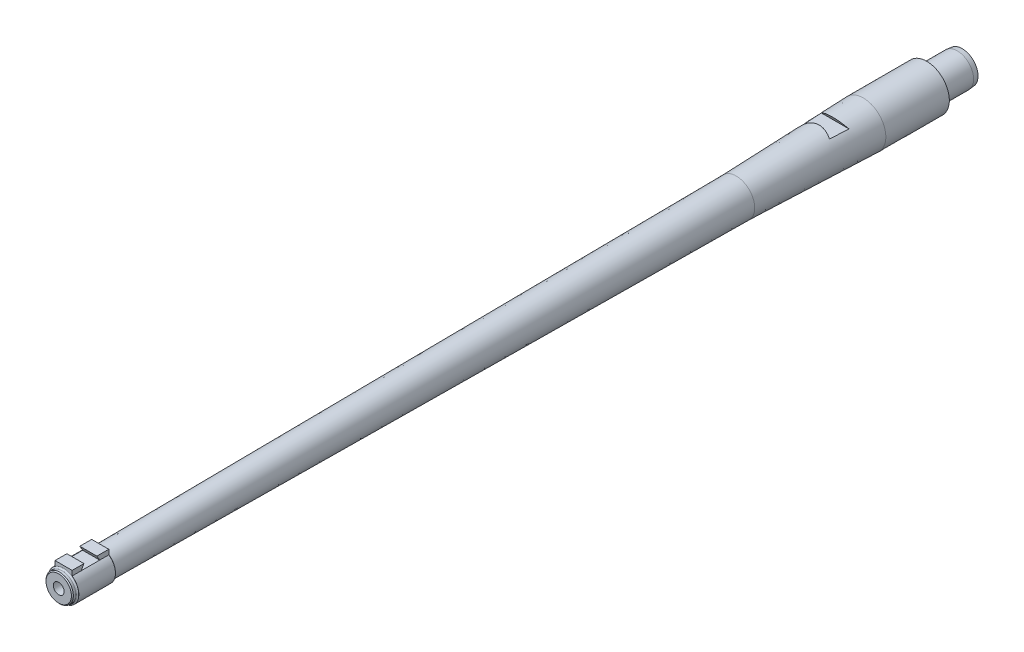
ISO-10303-21;
HEADER;
FILE_DESCRIPTION(('STEP AP214'),'2;1');
FILE_NAME('part.step','',(''),(''),'','','');
FILE_SCHEMA(('AUTOMOTIVE_DESIGN { 1 0 10303 214 1 1 1 1 }'));
ENDSEC;
DATA;
#1=APPLICATION_CONTEXT('core data for automotive mechanical design processes');
#2=APPLICATION_PROTOCOL_DEFINITION('international standard','automotive_design',2000,#1);
#3=PRODUCT_CONTEXT('',#1,'mechanical');
#4=PRODUCT('Part','Part','',(#3));
#5=PRODUCT_RELATED_PRODUCT_CATEGORY('part','',(#4));
#6=PRODUCT_DEFINITION_FORMATION('','',#4);
#7=PRODUCT_DEFINITION_CONTEXT('part definition',#1,'design');
#8=PRODUCT_DEFINITION('design','',#6,#7);
#9=PRODUCT_DEFINITION_SHAPE('','',#8);
#10=(LENGTH_UNIT() NAMED_UNIT(*) SI_UNIT(.MILLI.,.METRE.));
#11=(NAMED_UNIT(*) PLANE_ANGLE_UNIT() SI_UNIT($,.RADIAN.));
#12=(NAMED_UNIT(*) SI_UNIT($,.STERADIAN.) SOLID_ANGLE_UNIT());
#13=UNCERTAINTY_MEASURE_WITH_UNIT(LENGTH_MEASURE(1.E-05),#10,'distance_accuracy_value','');
#14=(GEOMETRIC_REPRESENTATION_CONTEXT(3) GLOBAL_UNCERTAINTY_ASSIGNED_CONTEXT((#13)) GLOBAL_UNIT_ASSIGNED_CONTEXT((#10,
#11,#12)) REPRESENTATION_CONTEXT('',''));
#15=CARTESIAN_POINT('',(0.,0.,0.));
#16=DIRECTION('',(0.,0.,1.));
#17=DIRECTION('',(1.,0.,0.));
#18=AXIS2_PLACEMENT_3D('',#15,#16,#17);
#19=CARTESIAN_POINT('',(0.,0.,-66.9625882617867));
#20=DIRECTION('',(0.,0.,-1.));
#21=DIRECTION('',(-1.,0.,0.));
#22=AXIS2_PLACEMENT_3D('',#19,#20,#21);
#23=CYLINDRICAL_SURFACE('',#22,8.509);
#24=CARTESIAN_POINT('',(0.,0.,-33.02));
#25=DIRECTION('',(0.,0.,-1.));
#26=DIRECTION('',(-1.,0.,0.));
#27=AXIS2_PLACEMENT_3D('',#24,#25,#26);
#28=CIRCLE('',#27,8.509);
#29=CARTESIAN_POINT('',(-8.509,0.,-33.02));
#30=VERTEX_POINT('',#29);
#31=EDGE_CURVE('E286',#30,#30,#28,.T.);
#32=ORIENTED_EDGE('',*,*,#31,.T.);
#33=EDGE_LOOP('',(#32));
#34=FACE_BOUND('',#33,.T.);
#35=CARTESIAN_POINT('',(0.,0.,-48.8949999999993));
#36=DIRECTION('',(0.,0.,-1.));
#37=DIRECTION('',(-1.,0.,0.));
#38=AXIS2_PLACEMENT_3D('',#35,#36,#37);
#39=CIRCLE('',#38,8.509);
#40=CARTESIAN_POINT('',(-7.95693315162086,-3.01501174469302,-48.8949999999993));
#41=VERTEX_POINT('',#40);
#42=CARTESIAN_POINT('',(-8.50826611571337,0.11175287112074,-48.8949999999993));
#43=VERTEX_POINT('',#42);
#44=EDGE_CURVE('E443',#41,#43,#39,.F.);
#45=ORIENTED_EDGE('',*,*,#44,.T.);
#46=DIRECTION('',(0.,0.,-1.));
#47=VECTOR('',#46,1.);
#48=CARTESIAN_POINT('',(-8.50826611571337,0.11175287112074,-66.9625882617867));
#49=LINE('',#48,#47);
#50=CARTESIAN_POINT('',(-8.50826611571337,0.11175287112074,-45.7833306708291));
#51=VERTEX_POINT('',#50);
#52=EDGE_CURVE('E187',#43,#51,#49,.F.);
#53=ORIENTED_EDGE('',*,*,#52,.T.);
#54=CARTESIAN_POINT('',(0.,0.,-54.3013630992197));
#55=DIRECTION('',(-0.702870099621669,-0.123934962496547,-0.700438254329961));
#56=DIRECTION('',(0.689797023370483,0.121629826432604,-0.713713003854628));
#57=AXIS2_PLACEMENT_3D('',#54,#55,#56);
#58=ELLIPSE('',#57,12.1481086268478,8.509);
#59=CARTESIAN_POINT('',(-7.95693315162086,-3.01501174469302,-45.7833306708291));
#60=VERTEX_POINT('',#59);
#61=EDGE_CURVE('E190',#51,#60,#58,.F.);
#62=ORIENTED_EDGE('',*,*,#61,.T.);
#63=DIRECTION('',(0.,0.,-1.));
#64=VECTOR('',#63,1.);
#65=CARTESIAN_POINT('',(-7.95693315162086,-3.01501174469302,-66.9625882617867));
#66=LINE('',#65,#64);
#67=EDGE_CURVE('E174',#41,#60,#66,.F.);
#68=ORIENTED_EDGE('',*,*,#67,.F.);
#69=EDGE_LOOP('',(#45,#53,#62,#68));
#70=FACE_BOUND('',#69,.T.);
#71=ADVANCED_FACE('F32',(#34,#70),#23,.T.);
#72=CARTESIAN_POINT('',(0.,8.509,-51.435));
#73=DIRECTION('',(0.,0.,-1.));
#74=DIRECTION('',(-1.,0.,0.));
#75=AXIS2_PLACEMENT_3D('',#72,#73,#74);
#76=PLANE('',#75);
#77=DIRECTION('',(0.173648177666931,-0.984807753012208,0.));
#78=VECTOR('',#77,1.);
#79=CARTESIAN_POINT('',(-3.04597993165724,1.07490130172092,-51.435));
#80=LINE('',#79,#78);
#81=CARTESIAN_POINT('',(-3.04597993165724,1.07490130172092,-51.435));
#82=VERTEX_POINT('',#81);
#83=CARTESIAN_POINT('',(-2.77031344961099,-0.488481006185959,-51.435));
#84=VERTEX_POINT('',#83);
#85=EDGE_CURVE('E165',#82,#84,#80,.T.);
#86=ORIENTED_EDGE('',*,*,#85,.F.);
#87=DIRECTION('',(-0.984807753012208,-0.173648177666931,0.));
#88=VECTOR('',#87,1.);
#89=CARTESIAN_POINT('',(-3.04597993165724,1.07490130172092,-51.435));
#90=LINE('',#89,#88);
#91=CARTESIAN_POINT('',(-8.25351311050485,0.156672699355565,-51.435));
#92=VERTEX_POINT('',#91);
#93=EDGE_CURVE('E169',#82,#92,#90,.T.);
#94=ORIENTED_EDGE('',*,*,#93,.T.);
#95=CARTESIAN_POINT('',(0.,0.,-51.435));
#96=DIRECTION('',(0.,0.,-1.));
#97=DIRECTION('',(-1.,0.,0.));
#98=AXIS2_PLACEMENT_3D('',#95,#96,#97);
#99=CIRCLE('',#98,8.25499999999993);
#100=CARTESIAN_POINT('',(-7.70218014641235,-2.9700919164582,-51.435));
#101=VERTEX_POINT('',#100);
#102=EDGE_CURVE('E180',#92,#101,#99,.T.);
#103=ORIENTED_EDGE('',*,*,#102,.T.);
#104=DIRECTION('',(-0.984807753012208,-0.173648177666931,0.));
#105=VECTOR('',#104,1.);
#106=CARTESIAN_POINT('',(-2.49464696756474,-2.05186331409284,-51.435));
#107=LINE('',#106,#105);
#108=CARTESIAN_POINT('',(-2.49464696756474,-2.05186331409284,-51.435));
#109=VERTEX_POINT('',#108);
#110=EDGE_CURVE('E53',#109,#101,#107,.T.);
#111=ORIENTED_EDGE('',*,*,#110,.F.);
#112=EDGE_CURVE('E161',#84,#109,#80,.T.);
#113=ORIENTED_EDGE('',*,*,#112,.F.);
#114=CARTESIAN_POINT('',(0.,0.,-51.435));
#115=DIRECTION('',(0.,0.,-1.));
#116=DIRECTION('',(-1.,0.,0.));
#117=AXIS2_PLACEMENT_3D('',#114,#115,#116);
#118=CIRCLE('',#117,2.81305);
#119=EDGE_CURVE('E284',#84,#84,#118,.T.);
#120=ORIENTED_EDGE('',*,*,#119,.F.);
#121=EDGE_LOOP('',(#86,#94,#103,#111,#113,#120));
#122=FACE_BOUND('',#121,.T.);
#123=ADVANCED_FACE('F177',(#122),#76,.T.);
#124=CARTESIAN_POINT('',(0.,0.,-51.435));
#125=DIRECTION('',(0.,0.,1.));
#126=DIRECTION('',(1.,0.,0.));
#127=AXIS2_PLACEMENT_3D('',#124,#125,#126);
#128=CONICAL_SURFACE('',#127,8.25499999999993,0.0996686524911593);
#129=ORIENTED_EDGE('',*,*,#102,.F.);
#130=CARTESIAN_POINT('',(-8.25349303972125,0.156676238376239,-51.4352));
#131=CARTESIAN_POINT('',(-8.29598226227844,0.14918424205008,-51.0118024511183));
#132=CARTESIAN_POINT('',(-8.33845963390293,0.141694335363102,-50.5884036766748));
#133=CARTESIAN_POINT('',(-8.42339067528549,0.12671870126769,-49.7416036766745));
#134=CARTESIAN_POINT('',(-8.46584434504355,0.119232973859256,-49.3182024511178));
#135=CARTESIAN_POINT('',(-8.50828616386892,0.111749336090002,-48.8947999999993));
#136=B_SPLINE_CURVE_WITH_KNOTS('',3,(#130,#131,#132,#133,#134,#135),.UNSPECIFIED.,.F.,.F.,(4,2,
4),(0.,1.27677035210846,2.55354070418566),.UNSPECIFIED.);
#137=EDGE_CURVE('E11',#92,#43,#136,.T.);
#138=ORIENTED_EDGE('',*,*,#137,.T.);
#139=ORIENTED_EDGE('',*,*,#44,.F.);
#140=CARTESIAN_POINT('',(-7.70216007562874,-2.97008837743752,-51.4352));
#141=CARTESIAN_POINT('',(-7.74464929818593,-2.97758037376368,-51.0118024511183));
#142=CARTESIAN_POINT('',(-7.78712666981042,-2.98507028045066,-50.5884036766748));
#143=CARTESIAN_POINT('',(-7.87205771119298,-3.00004591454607,-49.7416036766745));
#144=CARTESIAN_POINT('',(-7.91451138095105,-3.00753164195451,-49.3182024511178));
#145=CARTESIAN_POINT('',(-7.95695319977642,-3.01501527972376,-48.8947999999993));
#146=B_SPLINE_CURVE_WITH_KNOTS('',3,(#140,#141,#142,#143,#144,#145),.UNSPECIFIED.,.F.,.F.,(4,2,
4),(0.,1.27677035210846,2.55354070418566),.UNSPECIFIED.);
#147=EDGE_CURVE('E46',#101,#41,#146,.T.);
#148=ORIENTED_EDGE('',*,*,#147,.F.);
#149=EDGE_LOOP('',(#129,#138,#139,#148));
#150=FACE_BOUND('',#149,.T.);
#151=ADVANCED_FACE('F34',(#150),#128,.T.);
#152=CARTESIAN_POINT('',(0.,0.,0.));
#153=DIRECTION('',(0.,0.,-1.));
#154=DIRECTION('',(-1.,0.,0.));
#155=AXIS2_PLACEMENT_3D('',#152,#153,#154);
#156=CONICAL_SURFACE('',#155,11.7475,0.0326806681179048);
#157=CARTESIAN_POINT('',(0.,0.,66.04));
#158=DIRECTION('',(0.,0.,-1.));
#159=DIRECTION('',(-1.,0.,0.));
#160=AXIS2_PLACEMENT_3D('',#157,#158,#159);
#161=CIRCLE('',#160,9.5885);
#162=CARTESIAN_POINT('',(-9.5885,0.,66.04));
#163=VERTEX_POINT('',#162);
#164=EDGE_CURVE('E254',#163,#163,#161,.T.);
#165=ORIENTED_EDGE('',*,*,#164,.T.);
#166=EDGE_LOOP('',(#165));
#167=FACE_BOUND('',#166,.T.);
#168=CARTESIAN_POINT('',(0.,0.394043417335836,-9.34754341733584));
#169=DIRECTION('',(0.,0.707106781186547,0.707106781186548));
#170=DIRECTION('',(0.,0.707106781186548,-0.707106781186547));
#171=AXIS2_PLACEMENT_3D('',#168,#169,#170);
#172=ELLIPSE('',#171,17.0456472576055,12.0466499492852);
#173=CARTESIAN_POINT('',(7.60516890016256,-8.95350000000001,0.));
#174=VERTEX_POINT('',#173);
#175=CARTESIAN_POINT('',(-7.60516890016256,-8.95350000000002,0.));
#176=VERTEX_POINT('',#175);
#177=EDGE_CURVE('E250',#174,#176,#172,.F.);
#178=ORIENTED_EDGE('',*,*,#177,.F.);
#179=CARTESIAN_POINT('',(0.,0.,0.));
#180=DIRECTION('',(0.,0.,-1.));
#181=DIRECTION('',(-1.,0.,0.));
#182=AXIS2_PLACEMENT_3D('',#179,#180,#181);
#183=CIRCLE('',#182,11.7475);
#184=EDGE_CURVE('E292',#176,#174,#183,.T.);
#185=ORIENTED_EDGE('',*,*,#184,.F.);
#186=EDGE_LOOP('',(#178,#185));
#187=FACE_BOUND('',#186,.T.);
#188=CARTESIAN_POINT('',(8.14064121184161,8.68208656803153,-4.71439746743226));
#189=CARTESIAN_POINT('',(8.0543886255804,8.68208656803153,-2.90985139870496));
#190=CARTESIAN_POINT('',(7.96741339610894,8.68208656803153,-1.10533999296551));
#191=CARTESIAN_POINT('',(7.79185608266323,8.68208656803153,2.50360538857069));
#192=CARTESIAN_POINT('',(7.70327399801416,8.68208656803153,4.3080393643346));
#193=CARTESIAN_POINT('',(7.43487643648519,8.68208656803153,9.72118615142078));
#194=CARTESIAN_POINT('',(7.25240848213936,8.68208656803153,13.3297683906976));
#195=CARTESIAN_POINT('',(6.97206724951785,8.68208656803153,18.7423031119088));
#196=CARTESIAN_POINT('',(6.87751346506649,8.68208656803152,20.546427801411));
#197=CARTESIAN_POINT('',(6.68589295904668,8.68208656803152,24.1545434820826));
#198=CARTESIAN_POINT('',(6.58882623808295,8.68208656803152,25.958534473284));
#199=CARTESIAN_POINT('',(6.39183631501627,8.68208656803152,29.5663723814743));
#200=CARTESIAN_POINT('',(6.29191309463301,8.68208656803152,31.370219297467));
#201=CARTESIAN_POINT('',(6.08875280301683,8.68208656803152,34.9777279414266));
#202=CARTESIAN_POINT('',(5.98551572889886,8.68208656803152,36.7813896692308));
#203=CARTESIAN_POINT('',(5.88039283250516,8.68208656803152,38.5849424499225));
#204=B_SPLINE_CURVE_WITH_KNOTS('',3,(#188,#189,#190,#191,#192,#193,#194,#195,#196,#197,#198,
#199,#200,#201,#202,#203),.UNSPECIFIED.,.F.,.F.,(4,2,2,2,2,2,2,4),(0.,5.41981818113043,
10.839638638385,21.6792057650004,27.0990066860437,32.518806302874,37.9386406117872,
43.3584796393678),.UNSPECIFIED.);
#205=CARTESIAN_POINT('',(7.18574443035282,8.68208656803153,14.605));
#206=VERTEX_POINT('',#205);
#207=CARTESIAN_POINT('',(6.67997484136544,8.68208656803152,24.257));
#208=VERTEX_POINT('',#207);
#209=EDGE_CURVE('E314',#206,#208,#204,.T.);
#210=ORIENTED_EDGE('',*,*,#209,.T.);
#211=CARTESIAN_POINT('',(0.,0.203744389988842,29.1519731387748));
#212=DIRECTION('',(0.,-0.500000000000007,-0.866025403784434));
#213=DIRECTION('',(0.,0.866025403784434,-0.500000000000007));
#214=AXIS2_PLACEMENT_3D('',#211,#212,#213);
#215=ELLIPSE('',#214,12.4643626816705,10.7925317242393);
#216=CARTESIAN_POINT('',(-6.67997484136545,8.68208656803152,24.257));
#217=VERTEX_POINT('',#216);
#218=EDGE_CURVE('E446',#208,#217,#215,.F.);
#219=ORIENTED_EDGE('',*,*,#218,.T.);
#220=CARTESIAN_POINT('',(-5.88039283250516,8.68208656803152,38.5849424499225));
#221=CARTESIAN_POINT('',(-5.98551572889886,8.68208656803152,36.7813896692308));
#222=CARTESIAN_POINT('',(-6.08875280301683,8.68208656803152,34.9777279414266));
#223=CARTESIAN_POINT('',(-6.29191309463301,8.68208656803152,31.370219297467));
#224=CARTESIAN_POINT('',(-6.39183631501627,8.68208656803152,29.5663723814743));
#225=CARTESIAN_POINT('',(-6.58882623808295,8.68208656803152,25.958534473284));
#226=CARTESIAN_POINT('',(-6.68589295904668,8.68208656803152,24.1545434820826));
#227=CARTESIAN_POINT('',(-6.87751346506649,8.68208656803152,20.546427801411));
#228=CARTESIAN_POINT('',(-6.97206724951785,8.68208656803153,18.7423031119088));
#229=CARTESIAN_POINT('',(-7.25240848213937,8.68208656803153,13.3297683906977));
#230=CARTESIAN_POINT('',(-7.43487643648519,8.68208656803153,9.72118615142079));
#231=CARTESIAN_POINT('',(-7.70327399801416,8.68208656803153,4.30803936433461));
#232=CARTESIAN_POINT('',(-7.79185608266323,8.68208656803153,2.5036053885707));
#233=CARTESIAN_POINT('',(-7.96741339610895,8.68208656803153,-1.10533999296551));
#234=CARTESIAN_POINT('',(-8.0543886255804,8.68208656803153,-2.90985139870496));
#235=CARTESIAN_POINT('',(-8.14064121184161,8.68208656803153,-4.71439746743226));
#236=B_SPLINE_CURVE_WITH_KNOTS('',3,(#220,#221,#222,#223,#224,#225,#226,#227,#228,#229,#230,
#231,#232,#233,#234,#235),.UNSPECIFIED.,.F.,.F.,(4,2,2,2,2,2,2,4),(0.,5.41983902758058,
10.8396733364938,16.2594729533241,21.6792738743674,32.5188410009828,37.9386614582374,
43.3584796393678),.UNSPECIFIED.);
#237=CARTESIAN_POINT('',(-7.18574443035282,8.68208656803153,14.605));
#238=VERTEX_POINT('',#237);
#239=EDGE_CURVE('E322',#217,#238,#236,.T.);
#240=ORIENTED_EDGE('',*,*,#239,.T.);
#241=CARTESIAN_POINT('',(0.,-0.215890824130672,9.46775035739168));
#242=DIRECTION('',(0.,-0.50000000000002,0.866025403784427));
#243=DIRECTION('',(0.,-0.866025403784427,-0.50000000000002));
#244=AXIS2_PLACEMENT_3D('',#241,#242,#243);
#245=ELLIPSE('',#244,13.2074386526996,11.435939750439);
#246=EDGE_CURVE('E311',#238,#206,#245,.F.);
#247=ORIENTED_EDGE('',*,*,#246,.T.);
#248=EDGE_LOOP('',(#210,#219,#240,#247));
#249=FACE_BOUND('',#248,.T.);
#250=ADVANCED_FACE('F328',(#167,#187,#249),#156,.T.);
#251=CARTESIAN_POINT('',(-4.445,9.11616006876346,425.170739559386));
#252=DIRECTION('',(0.,1.,0.));
#253=DIRECTION('',(0.,0.,1.));
#254=AXIS2_PLACEMENT_3D('',#251,#252,#253);
#255=PLANE('',#254);
#256=DIRECTION('',(1.,0.,0.));
#257=VECTOR('',#256,1.);
#258=CARTESIAN_POINT('',(-11.7475,9.11616006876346,409.759530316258));
#259=LINE('',#258,#257);
#260=CARTESIAN_POINT('',(-4.445,9.11616006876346,409.759530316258));
#261=VERTEX_POINT('',#260);
#262=CARTESIAN_POINT('',(4.445,9.11616006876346,409.759530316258));
#263=VERTEX_POINT('',#262);
#264=EDGE_CURVE('E201',#261,#263,#259,.T.);
#265=ORIENTED_EDGE('',*,*,#264,.F.);
#266=DIRECTION('',(0.,0.,-1.));
#267=VECTOR('',#266,1.);
#268=CARTESIAN_POINT('',(-4.445,9.11616006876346,425.170739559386));
#269=LINE('',#268,#267);
#270=CARTESIAN_POINT('',(-4.445,9.11616006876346,415.925));
#271=VERTEX_POINT('',#270);
#272=EDGE_CURVE('E225',#271,#261,#269,.T.);
#273=ORIENTED_EDGE('',*,*,#272,.F.);
#274=DIRECTION('',(1.,0.,0.));
#275=VECTOR('',#274,1.);
#276=CARTESIAN_POINT('',(-4.445,9.11616006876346,415.925));
#277=LINE('',#276,#275);
#278=CARTESIAN_POINT('',(4.445,9.11616006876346,415.925));
#279=VERTEX_POINT('',#278);
#280=EDGE_CURVE('E220',#271,#279,#277,.T.);
#281=ORIENTED_EDGE('',*,*,#280,.T.);
#282=DIRECTION('',(0.,0.,-1.));
#283=VECTOR('',#282,1.);
#284=CARTESIAN_POINT('',(4.445,9.11616006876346,425.170739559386));
#285=LINE('',#284,#283);
#286=EDGE_CURVE('E233',#279,#263,#285,.T.);
#287=ORIENTED_EDGE('',*,*,#286,.T.);
#288=EDGE_LOOP('',(#265,#273,#281,#287));
#289=FACE_BOUND('',#288,.T.);
#290=ADVANCED_FACE('F367',(#289),#255,.T.);
#291=CARTESIAN_POINT('',(4.445,9.11616006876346,425.170739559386));
#292=DIRECTION('',(1.,0.,0.));
#293=DIRECTION('',(0.,0.,-1.));
#294=AXIS2_PLACEMENT_3D('',#291,#292,#293);
#295=PLANE('',#294);
#296=DIRECTION('',(0.,-0.866025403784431,0.500000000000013));
#297=VECTOR('',#296,1.);
#298=CARTESIAN_POINT('',(4.445,2.4429107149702,413.612332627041));
#299=LINE('',#298,#297);
#300=CARTESIAN_POINT('',(4.445,6.57616006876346,411.226));
#301=VERTEX_POINT('',#300);
#302=EDGE_CURVE('E209',#263,#301,#299,.T.);
#303=ORIENTED_EDGE('',*,*,#302,.F.);
#304=ORIENTED_EDGE('',*,*,#286,.F.);
#305=DIRECTION('',(0.,-1.,0.));
#306=VECTOR('',#305,1.);
#307=CARTESIAN_POINT('',(4.445,9.11616006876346,415.925));
#308=LINE('',#307,#306);
#309=CARTESIAN_POINT('',(4.445,6.57616006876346,415.925));
#310=VERTEX_POINT('',#309);
#311=EDGE_CURVE('E230',#279,#310,#308,.T.);
#312=ORIENTED_EDGE('',*,*,#311,.T.);
#313=DIRECTION('',(0.,0.,-1.));
#314=VECTOR('',#313,1.);
#315=CARTESIAN_POINT('',(4.445,6.57616006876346,425.170739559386));
#316=LINE('',#315,#314);
#317=EDGE_CURVE('E240',#310,#301,#316,.T.);
#318=ORIENTED_EDGE('',*,*,#317,.T.);
#319=EDGE_LOOP('',(#303,#304,#312,#318));
#320=FACE_BOUND('',#319,.T.);
#321=ADVANCED_FACE('F362',(#320),#295,.T.);
#322=CARTESIAN_POINT('',(-4.445,9.11616006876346,425.170739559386));
#323=DIRECTION('',(1.,0.,0.));
#324=DIRECTION('',(0.,0.,-1.));
#325=AXIS2_PLACEMENT_3D('',#322,#323,#324);
#326=PLANE('',#325);
#327=ORIENTED_EDGE('',*,*,#272,.T.);
#328=DIRECTION('',(0.,-0.866025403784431,0.500000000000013));
#329=VECTOR('',#328,1.);
#330=CARTESIAN_POINT('',(-4.445,2.4429107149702,413.612332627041));
#331=LINE('',#330,#329);
#332=CARTESIAN_POINT('',(-4.445,6.57616006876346,411.226));
#333=VERTEX_POINT('',#332);
#334=EDGE_CURVE('E308',#261,#333,#331,.T.);
#335=ORIENTED_EDGE('',*,*,#334,.T.);
#336=DIRECTION('',(0.,0.,-1.));
#337=VECTOR('',#336,1.);
#338=CARTESIAN_POINT('',(-4.445,6.57616006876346,425.170739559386));
#339=LINE('',#338,#337);
#340=CARTESIAN_POINT('',(-4.445,6.57616006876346,415.925));
#341=VERTEX_POINT('',#340);
#342=EDGE_CURVE('E234',#341,#333,#339,.T.);
#343=ORIENTED_EDGE('',*,*,#342,.F.);
#344=DIRECTION('',(0.,-1.,0.));
#345=VECTOR('',#344,1.);
#346=CARTESIAN_POINT('',(-4.445,9.11616006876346,415.925));
#347=LINE('',#346,#345);
#348=EDGE_CURVE('E213',#271,#341,#347,.T.);
#349=ORIENTED_EDGE('',*,*,#348,.F.);
#350=EDGE_LOOP('',(#327,#335,#343,#349));
#351=FACE_BOUND('',#350,.T.);
#352=ADVANCED_FACE('F357',(#351),#326,.F.);
#353=CARTESIAN_POINT('',(0.,0.,-66.9625882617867));
#354=DIRECTION('',(0.,0.,-1.));
#355=DIRECTION('',(-1.,0.,0.));
#356=AXIS2_PLACEMENT_3D('',#353,#354,#355);
#357=CYLINDRICAL_SURFACE('',#356,11.7475);
#358=CARTESIAN_POINT('',(0.,0.,-8.95350000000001));
#359=DIRECTION('',(0.,0.707106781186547,0.707106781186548));
#360=DIRECTION('',(0.,0.707106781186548,-0.707106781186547));
#361=AXIS2_PLACEMENT_3D('',#358,#359,#360);
#362=ELLIPSE('',#361,16.6134738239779,11.7475);
#363=CARTESIAN_POINT('',(9.2020242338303,-7.3025,-1.65100000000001));
#364=VERTEX_POINT('',#363);
#365=EDGE_CURVE('E304',#364,#174,#362,.F.);
#366=ORIENTED_EDGE('',*,*,#365,.F.);
#367=DIRECTION('',(0.,0.,-1.));
#368=VECTOR('',#367,1.);
#369=CARTESIAN_POINT('',(9.2020242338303,-7.30249999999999,-66.9625882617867));
#370=LINE('',#369,#368);
#371=CARTESIAN_POINT('',(9.2020242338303,-7.3025,-14.351));
#372=VERTEX_POINT('',#371);
#373=EDGE_CURVE('E300',#372,#364,#370,.F.);
#374=ORIENTED_EDGE('',*,*,#373,.F.);
#375=CARTESIAN_POINT('',(0.,0.,-21.6535));
#376=DIRECTION('',(0.,-0.707106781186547,-0.707106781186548));
#377=DIRECTION('',(0.,0.707106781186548,-0.707106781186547));
#378=AXIS2_PLACEMENT_3D('',#375,#376,#377);
#379=ELLIPSE('',#378,16.6134738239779,11.7475);
#380=CARTESIAN_POINT('',(-9.2020242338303,-7.3025,-14.351));
#381=VERTEX_POINT('',#380);
#382=EDGE_CURVE('E295',#381,#372,#379,.F.);
#383=ORIENTED_EDGE('',*,*,#382,.F.);
#384=DIRECTION('',(0.,0.,-1.));
#385=VECTOR('',#384,1.);
#386=CARTESIAN_POINT('',(-9.2020242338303,-7.30249999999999,-66.9625882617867));
#387=LINE('',#386,#385);
#388=CARTESIAN_POINT('',(-9.2020242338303,-7.3025,-1.65100000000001));
#389=VERTEX_POINT('',#388);
#390=EDGE_CURVE('E297',#389,#381,#387,.T.);
#391=ORIENTED_EDGE('',*,*,#390,.F.);
#392=EDGE_CURVE('E302',#176,#389,#362,.F.);
#393=ORIENTED_EDGE('',*,*,#392,.F.);
#394=ORIENTED_EDGE('',*,*,#184,.T.);
#395=EDGE_LOOP('',(#366,#374,#383,#391,#393,#394));
#396=FACE_BOUND('',#395,.T.);
#397=CARTESIAN_POINT('',(0.,0.,-33.02));
#398=DIRECTION('',(0.,0.,-1.));
#399=DIRECTION('',(-1.,0.,0.));
#400=AXIS2_PLACEMENT_3D('',#397,#398,#399);
#401=CIRCLE('',#400,11.7475);
#402=CARTESIAN_POINT('',(-11.7475,0.,-33.02));
#403=VERTEX_POINT('',#402);
#404=EDGE_CURVE('E289',#403,#403,#401,.T.);
#405=ORIENTED_EDGE('',*,*,#404,.F.);
#406=EDGE_LOOP('',(#405));
#407=FACE_BOUND('',#406,.T.);
#408=ADVANCED_FACE('F426',(#396,#407),#357,.T.);
#409=CARTESIAN_POINT('',(0.,11.7475,-33.02));
#410=DIRECTION('',(0.,0.,-1.));
#411=DIRECTION('',(-1.,0.,0.));
#412=AXIS2_PLACEMENT_3D('',#409,#410,#411);
#413=PLANE('',#412);
#414=ORIENTED_EDGE('',*,*,#404,.T.);
#415=EDGE_LOOP('',(#414));
#416=FACE_BOUND('',#415,.T.);
#417=ORIENTED_EDGE('',*,*,#31,.F.);
#418=EDGE_LOOP('',(#417));
#419=FACE_BOUND('',#418,.T.);
#420=ADVANCED_FACE('F418',(#416,#419),#413,.T.);
#421=CARTESIAN_POINT('',(0.,0.,-66.9625882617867));
#422=DIRECTION('',(0.,0.,-1.));
#423=DIRECTION('',(-1.,0.,0.));
#424=AXIS2_PLACEMENT_3D('',#421,#422,#423);
#425=CYLINDRICAL_SURFACE('',#424,2.81304999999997);
#426=ORIENTED_EDGE('',*,*,#119,.T.);
#427=EDGE_LOOP('',(#426));
#428=FACE_BOUND('',#427,.T.);
#429=CARTESIAN_POINT('',(0.,0.,418.465));
#430=DIRECTION('',(0.,0.,-1.));
#431=DIRECTION('',(-1.,0.,0.));
#432=AXIS2_PLACEMENT_3D('',#429,#430,#431);
#433=CIRCLE('',#432,2.81304999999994);
#434=CARTESIAN_POINT('',(-2.81304999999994,0.,418.465));
#435=VERTEX_POINT('',#434);
#436=EDGE_CURVE('E281',#435,#435,#433,.T.);
#437=ORIENTED_EDGE('',*,*,#436,.F.);
#438=EDGE_LOOP('',(#437));
#439=FACE_BOUND('',#438,.T.);
#440=ADVANCED_FACE('F414',(#428,#439),#425,.F.);
#441=CARTESIAN_POINT('',(0.,6.604,418.465));
#442=DIRECTION('',(0.,0.,1.));
#443=DIRECTION('',(1.,0.,0.));
#444=AXIS2_PLACEMENT_3D('',#441,#442,#443);
#445=PLANE('',#444);
#446=ORIENTED_EDGE('',*,*,#436,.T.);
#447=EDGE_LOOP('',(#446));
#448=FACE_BOUND('',#447,.T.);
#449=CARTESIAN_POINT('',(0.,0.,418.465));
#450=DIRECTION('',(0.,0.,-1.));
#451=DIRECTION('',(-1.,0.,0.));
#452=AXIS2_PLACEMENT_3D('',#449,#450,#451);
#453=CIRCLE('',#452,6.604);
#454=CARTESIAN_POINT('',(-6.604,0.,418.465));
#455=VERTEX_POINT('',#454);
#456=EDGE_CURVE('E278',#455,#455,#453,.T.);
#457=ORIENTED_EDGE('',*,*,#456,.F.);
#458=EDGE_LOOP('',(#457));
#459=FACE_BOUND('',#458,.T.);
#460=ADVANCED_FACE('F410',(#448,#459),#445,.T.);
#461=CARTESIAN_POINT('',(0.,0.,417.957));
#462=DIRECTION('',(0.,0.,-1.));
#463=DIRECTION('',(-1.,0.,0.));
#464=AXIS2_PLACEMENT_3D('',#461,#462,#463);
#465=CONICAL_SURFACE('',#464,7.112,0.78539816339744);
#466=ORIENTED_EDGE('',*,*,#456,.T.);
#467=EDGE_LOOP('',(#466));
#468=FACE_BOUND('',#467,.T.);
#469=CARTESIAN_POINT('',(0.,0.,417.957));
#470=DIRECTION('',(0.,0.,-1.));
#471=DIRECTION('',(-1.,0.,0.));
#472=AXIS2_PLACEMENT_3D('',#469,#470,#471);
#473=CIRCLE('',#472,7.112);
#474=CARTESIAN_POINT('',(-7.112,0.,417.957));
#475=VERTEX_POINT('',#474);
#476=EDGE_CURVE('E275',#475,#475,#473,.T.);
#477=ORIENTED_EDGE('',*,*,#476,.F.);
#478=EDGE_LOOP('',(#477));
#479=FACE_BOUND('',#478,.T.);
#480=ADVANCED_FACE('F406',(#468,#479),#465,.T.);
#481=CARTESIAN_POINT('',(0.,0.,-66.9625882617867));
#482=DIRECTION('',(0.,0.,-1.));
#483=DIRECTION('',(-1.,0.,0.));
#484=AXIS2_PLACEMENT_3D('',#481,#482,#483);
#485=CYLINDRICAL_SURFACE('',#484,7.112);
#486=ORIENTED_EDGE('',*,*,#476,.T.);
#487=EDGE_LOOP('',(#486));
#488=FACE_BOUND('',#487,.T.);
#489=CARTESIAN_POINT('',(0.,0.,416.687));
#490=DIRECTION('',(0.,0.,-1.));
#491=DIRECTION('',(-1.,0.,0.));
#492=AXIS2_PLACEMENT_3D('',#489,#490,#491);
#493=CIRCLE('',#492,7.11200000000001);
#494=CARTESIAN_POINT('',(-7.11200000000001,0.,416.687));
#495=VERTEX_POINT('',#494);
#496=EDGE_CURVE('E272',#495,#495,#493,.T.);
#497=ORIENTED_EDGE('',*,*,#496,.F.);
#498=EDGE_LOOP('',(#497));
#499=FACE_BOUND('',#498,.T.);
#500=ADVANCED_FACE('F402',(#488,#499),#485,.T.);
#501=CARTESIAN_POINT('',(0.,0.,416.687));
#502=DIRECTION('',(0.,0.,-1.));
#503=DIRECTION('',(-1.,0.,0.));
#504=AXIS2_PLACEMENT_3D('',#501,#502,#503);
#505=TOROIDAL_SURFACE('',#504,7.874,0.761999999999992);
#506=ORIENTED_EDGE('',*,*,#496,.T.);
#507=EDGE_LOOP('',(#506));
#508=FACE_BOUND('',#507,.T.);
#509=CARTESIAN_POINT('',(0.,0.,415.925));
#510=DIRECTION('',(0.,0.,-1.));
#511=DIRECTION('',(-1.,0.,0.));
#512=AXIS2_PLACEMENT_3D('',#509,#510,#511);
#513=CIRCLE('',#512,7.874);
#514=CARTESIAN_POINT('',(-7.874,0.,415.925));
#515=VERTEX_POINT('',#514);
#516=EDGE_CURVE('E269',#515,#515,#513,.T.);
#517=ORIENTED_EDGE('',*,*,#516,.F.);
#518=EDGE_LOOP('',(#517));
#519=FACE_BOUND('',#518,.T.);
#520=ADVANCED_FACE('F398',(#508,#519),#505,.F.);
#521=CARTESIAN_POINT('',(0.,7.93749999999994,415.925));
#522=DIRECTION('',(0.,0.,1.));
#523=DIRECTION('',(1.,0.,0.));
#524=AXIS2_PLACEMENT_3D('',#521,#522,#523);
#525=PLANE('',#524);
#526=ORIENTED_EDGE('',*,*,#516,.T.);
#527=EDGE_LOOP('',(#526));
#528=FACE_BOUND('',#527,.T.);
#529=CARTESIAN_POINT('',(0.,0.,415.925));
#530=DIRECTION('',(0.,0.,-1.));
#531=DIRECTION('',(-1.,0.,0.));
#532=AXIS2_PLACEMENT_3D('',#529,#530,#531);
#533=CIRCLE('',#532,7.93749999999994);
#534=EDGE_CURVE('E266',#310,#341,#533,.T.);
#535=ORIENTED_EDGE('',*,*,#534,.F.);
#536=ORIENTED_EDGE('',*,*,#311,.F.);
#537=ORIENTED_EDGE('',*,*,#280,.F.);
#538=ORIENTED_EDGE('',*,*,#348,.T.);
#539=EDGE_LOOP('',(#535,#536,#537,#538));
#540=FACE_BOUND('',#539,.T.);
#541=ADVANCED_FACE('F394',(#528,#540),#525,.T.);
#542=CARTESIAN_POINT('',(0.,0.,-66.9625882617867));
#543=DIRECTION('',(0.,0.,-1.));
#544=DIRECTION('',(-1.,0.,0.));
#545=AXIS2_PLACEMENT_3D('',#542,#543,#544);
#546=CYLINDRICAL_SURFACE('',#545,7.93749999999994);
#547=ORIENTED_EDGE('',*,*,#317,.F.);
#548=ORIENTED_EDGE('',*,*,#534,.T.);
#549=ORIENTED_EDGE('',*,*,#342,.T.);
#550=CARTESIAN_POINT('',(-4.445,6.57616006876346,401.574));
#551=VERTEX_POINT('',#550);
#552=EDGE_CURVE('E238',#333,#551,#339,.T.);
#553=ORIENTED_EDGE('',*,*,#552,.T.);
#554=CARTESIAN_POINT('',(-4.445,6.57616006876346,396.875));
#555=VERTEX_POINT('',#554);
#556=EDGE_CURVE('E239',#551,#555,#339,.T.);
#557=ORIENTED_EDGE('',*,*,#556,.T.);
#558=CARTESIAN_POINT('',(0.,0.,396.875));
#559=DIRECTION('',(0.,0.,-1.));
#560=DIRECTION('',(-1.,0.,0.));
#561=AXIS2_PLACEMENT_3D('',#558,#559,#560);
#562=CIRCLE('',#561,7.93749999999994);
#563=CARTESIAN_POINT('',(4.445,6.57616006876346,396.875));
#564=VERTEX_POINT('',#563);
#565=EDGE_CURVE('E263',#564,#555,#562,.T.);
#566=ORIENTED_EDGE('',*,*,#565,.F.);
#567=CARTESIAN_POINT('',(4.445,6.57616006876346,401.574));
#568=VERTEX_POINT('',#567);
#569=EDGE_CURVE('E232',#568,#564,#316,.T.);
#570=ORIENTED_EDGE('',*,*,#569,.F.);
#571=DIRECTION('',(0.,0.,-1.));
#572=VECTOR('',#571,1.);
#573=CARTESIAN_POINT('',(4.445,6.57616006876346,425.170739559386));
#574=LINE('',#573,#572);
#575=EDGE_CURVE('E211',#301,#568,#574,.T.);
#576=ORIENTED_EDGE('',*,*,#575,.F.);
#577=EDGE_LOOP('',(#547,#548,#549,#553,#557,#566,#570,#576));
#578=FACE_BOUND('',#577,.T.);
#579=ADVANCED_FACE('F390',(#578),#546,.T.);
#580=CARTESIAN_POINT('',(0.,7.8797253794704,396.875));
#581=DIRECTION('',(0.,0.,-1.));
#582=DIRECTION('',(-1.,0.,0.));
#583=AXIS2_PLACEMENT_3D('',#580,#581,#582);
#584=PLANE('',#583);
#585=ORIENTED_EDGE('',*,*,#565,.T.);
#586=DIRECTION('',(0.,-1.,0.));
#587=VECTOR('',#586,1.);
#588=CARTESIAN_POINT('',(-4.445,9.11616006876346,396.875));
#589=LINE('',#588,#587);
#590=CARTESIAN_POINT('',(-4.445,9.11616006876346,396.875));
#591=VERTEX_POINT('',#590);
#592=EDGE_CURVE('E221',#591,#555,#589,.T.);
#593=ORIENTED_EDGE('',*,*,#592,.F.);
#594=DIRECTION('',(1.,0.,0.));
#595=VECTOR('',#594,1.);
#596=CARTESIAN_POINT('',(-4.445,9.11616006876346,396.875));
#597=LINE('',#596,#595);
#598=CARTESIAN_POINT('',(4.445,9.11616006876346,396.875));
#599=VERTEX_POINT('',#598);
#600=EDGE_CURVE('E214',#591,#599,#597,.T.);
#601=ORIENTED_EDGE('',*,*,#600,.T.);
#602=DIRECTION('',(0.,-1.,0.));
#603=VECTOR('',#602,1.);
#604=CARTESIAN_POINT('',(4.445,9.11616006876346,396.875));
#605=LINE('',#604,#603);
#606=EDGE_CURVE('E217',#599,#564,#605,.T.);
#607=ORIENTED_EDGE('',*,*,#606,.T.);
#608=EDGE_LOOP('',(#585,#593,#601,#607));
#609=FACE_BOUND('',#608,.T.);
#610=CARTESIAN_POINT('',(0.,0.,396.875));
#611=DIRECTION('',(0.,0.,-1.));
#612=DIRECTION('',(-1.,0.,0.));
#613=AXIS2_PLACEMENT_3D('',#610,#611,#612);
#614=CIRCLE('',#613,7.8797253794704);
#615=CARTESIAN_POINT('',(-7.8797253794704,0.,396.875));
#616=VERTEX_POINT('',#615);
#617=EDGE_CURVE('E260',#616,#616,#614,.T.);
#618=ORIENTED_EDGE('',*,*,#617,.F.);
#619=EDGE_LOOP('',(#618));
#620=FACE_BOUND('',#619,.T.);
#621=ADVANCED_FACE('F386',(#609,#620),#584,.T.);
#622=CARTESIAN_POINT('',(0.,0.,396.113));
#623=DIRECTION('',(0.,0.,-1.));
#624=DIRECTION('',(-1.,0.,0.));
#625=AXIS2_PLACEMENT_3D('',#622,#623,#624);
#626=TOROIDAL_SURFACE('',#625,7.87972537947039,0.761999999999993);
#627=ORIENTED_EDGE('',*,*,#617,.T.);
#628=EDGE_LOOP('',(#627));
#629=FACE_BOUND('',#628,.T.);
#630=CARTESIAN_POINT('',(0.,0.,396.107296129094));
#631=DIRECTION('',(0.,0.,-1.));
#632=DIRECTION('',(-1.,0.,0.));
#633=AXIS2_PLACEMENT_3D('',#630,#631,#632);
#634=CIRCLE('',#633,7.1177467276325);
#635=CARTESIAN_POINT('',(-7.1177467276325,0.,396.107296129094));
#636=VERTEX_POINT('',#635);
#637=EDGE_CURVE('E257',#636,#636,#634,.T.);
#638=ORIENTED_EDGE('',*,*,#637,.F.);
#639=EDGE_LOOP('',(#638));
#640=FACE_BOUND('',#639,.T.);
#641=ADVANCED_FACE('F382',(#629,#640),#626,.F.);
#642=CARTESIAN_POINT('',(0.,0.,66.04));
#643=DIRECTION('',(0.,0.,-1.));
#644=DIRECTION('',(-1.,0.,0.));
#645=AXIS2_PLACEMENT_3D('',#642,#643,#644);
#646=CONICAL_SURFACE('',#645,9.5885,0.00748546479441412);
#647=ORIENTED_EDGE('',*,*,#637,.T.);
#648=EDGE_LOOP('',(#647));
#649=FACE_BOUND('',#648,.T.);
#650=ORIENTED_EDGE('',*,*,#164,.F.);
#651=EDGE_LOOP('',(#650));
#652=FACE_BOUND('',#651,.T.);
#653=ADVANCED_FACE('F372',(#649,#652),#646,.T.);
#654=CARTESIAN_POINT('',(-11.7475,-7.3025,-1.65100000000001));
#655=DIRECTION('',(0.,0.707106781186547,0.707106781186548));
#656=DIRECTION('',(0.,-0.707106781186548,0.707106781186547));
#657=AXIS2_PLACEMENT_3D('',#654,#655,#656);
#658=PLANE('',#657);
#659=ORIENTED_EDGE('',*,*,#365,.T.);
#660=ORIENTED_EDGE('',*,*,#177,.T.);
#661=ORIENTED_EDGE('',*,*,#392,.T.);
#662=DIRECTION('',(1.,0.,0.));
#663=VECTOR('',#662,1.);
#664=CARTESIAN_POINT('',(-11.7475,-7.3025,-1.65100000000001));
#665=LINE('',#664,#663);
#666=EDGE_CURVE('E247',#389,#364,#665,.T.);
#667=ORIENTED_EDGE('',*,*,#666,.T.);
#668=EDGE_LOOP('',(#659,#660,#661,#667));
#669=FACE_BOUND('',#668,.T.);
#670=ADVANCED_FACE('F368',(#669),#658,.F.);
#671=CARTESIAN_POINT('',(-11.7475,-7.3025,-14.351));
#672=DIRECTION('',(0.,1.,0.));
#673=DIRECTION('',(0.,0.,1.));
#674=AXIS2_PLACEMENT_3D('',#671,#672,#673);
#675=PLANE('',#674);
#676=ORIENTED_EDGE('',*,*,#373,.T.);
#677=ORIENTED_EDGE('',*,*,#666,.F.);
#678=ORIENTED_EDGE('',*,*,#390,.T.);
#679=DIRECTION('',(1.,0.,0.));
#680=VECTOR('',#679,1.);
#681=CARTESIAN_POINT('',(-11.7475,-7.3025,-14.351));
#682=LINE('',#681,#680);
#683=EDGE_CURVE('E224',#381,#372,#682,.T.);
#684=ORIENTED_EDGE('',*,*,#683,.T.);
#685=EDGE_LOOP('',(#676,#677,#678,#684));
#686=FACE_BOUND('',#685,.T.);
#687=ADVANCED_FACE('F371',(#686),#675,.F.);
#688=CARTESIAN_POINT('',(-11.7475,-23.1350496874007,1.48154968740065));
#689=DIRECTION('',(0.,-0.707106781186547,-0.707106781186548));
#690=DIRECTION('',(0.,0.707106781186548,-0.707106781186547));
#691=AXIS2_PLACEMENT_3D('',#688,#689,#690);
#692=PLANE('',#691);
#693=ORIENTED_EDGE('',*,*,#382,.T.);
#694=ORIENTED_EDGE('',*,*,#683,.F.);
#695=EDGE_LOOP('',(#693,#694));
#696=FACE_BOUND('',#695,.T.);
#697=ADVANCED_FACE('F365',(#696),#692,.F.);
#698=DIRECTION('',(1.,0.,0.));
#699=VECTOR('',#698,1.);
#700=CARTESIAN_POINT('',(-11.7475,9.11616006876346,403.040469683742));
#701=LINE('',#700,#699);
#702=CARTESIAN_POINT('',(-4.445,9.11616006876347,403.040469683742));
#703=VERTEX_POINT('',#702);
#704=CARTESIAN_POINT('',(4.445,9.11616006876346,403.040469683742));
#705=VERTEX_POINT('',#704);
#706=EDGE_CURVE('E203',#703,#705,#701,.T.);
#707=ORIENTED_EDGE('',*,*,#706,.T.);
#708=EDGE_CURVE('E228',#705,#599,#285,.T.);
#709=ORIENTED_EDGE('',*,*,#708,.T.);
#710=ORIENTED_EDGE('',*,*,#600,.F.);
#711=EDGE_CURVE('E237',#703,#591,#269,.T.);
#712=ORIENTED_EDGE('',*,*,#711,.F.);
#713=EDGE_LOOP('',(#707,#709,#710,#712));
#714=FACE_BOUND('',#713,.T.);
#715=ADVANCED_FACE('F360',(#714),#255,.T.);
#716=DIRECTION('',(0.,0.866025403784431,0.500000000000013));
#717=VECTOR('',#716,1.);
#718=CARTESIAN_POINT('',(4.445,18.6988480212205,408.573037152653));
#719=LINE('',#718,#717);
#720=EDGE_CURVE('E200',#568,#705,#719,.T.);
#721=ORIENTED_EDGE('',*,*,#720,.F.);
#722=ORIENTED_EDGE('',*,*,#569,.T.);
#723=ORIENTED_EDGE('',*,*,#606,.F.);
#724=ORIENTED_EDGE('',*,*,#708,.F.);
#725=EDGE_LOOP('',(#721,#722,#723,#724));
#726=FACE_BOUND('',#725,.T.);
#727=ADVANCED_FACE('F355',(#726),#295,.T.);
#728=ORIENTED_EDGE('',*,*,#556,.F.);
#729=DIRECTION('',(0.,0.866025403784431,0.500000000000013));
#730=VECTOR('',#729,1.);
#731=CARTESIAN_POINT('',(-4.445,18.6988480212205,408.573037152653));
#732=LINE('',#731,#730);
#733=EDGE_CURVE('E305',#551,#703,#732,.T.);
#734=ORIENTED_EDGE('',*,*,#733,.T.);
#735=ORIENTED_EDGE('',*,*,#711,.T.);
#736=ORIENTED_EDGE('',*,*,#592,.T.);
#737=EDGE_LOOP('',(#728,#734,#735,#736));
#738=FACE_BOUND('',#737,.T.);
#739=ADVANCED_FACE('F351',(#738),#326,.F.);
#740=CARTESIAN_POINT('',(-11.7475,6.57616006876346,401.574));
#741=DIRECTION('',(0.,-1.,0.));
#742=DIRECTION('',(0.,0.,-1.));
#743=AXIS2_PLACEMENT_3D('',#740,#741,#742);
#744=PLANE('',#743);
#745=ORIENTED_EDGE('',*,*,#575,.T.);
#746=DIRECTION('',(1.,0.,0.));
#747=VECTOR('',#746,1.);
#748=CARTESIAN_POINT('',(-11.7475,6.57616006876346,401.574));
#749=LINE('',#748,#747);
#750=EDGE_CURVE('E196',#551,#568,#749,.T.);
#751=ORIENTED_EDGE('',*,*,#750,.F.);
#752=ORIENTED_EDGE('',*,*,#552,.F.);
#753=DIRECTION('',(1.,0.,0.));
#754=VECTOR('',#753,1.);
#755=CARTESIAN_POINT('',(-11.7475,6.57616006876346,411.226));
#756=LINE('',#755,#754);
#757=EDGE_CURVE('E197',#333,#301,#756,.T.);
#758=ORIENTED_EDGE('',*,*,#757,.T.);
#759=EDGE_LOOP('',(#745,#751,#752,#758));
#760=FACE_BOUND('',#759,.T.);
#761=ADVANCED_FACE('F344',(#760),#744,.F.);
#762=CARTESIAN_POINT('',(-11.7475,6.57616006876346,411.226));
#763=DIRECTION('',(0.,0.500000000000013,0.866025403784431));
#764=DIRECTION('',(0.,-0.866025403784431,0.500000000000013));
#765=AXIS2_PLACEMENT_3D('',#762,#763,#764);
#766=PLANE('',#765);
#767=ORIENTED_EDGE('',*,*,#302,.T.);
#768=ORIENTED_EDGE('',*,*,#757,.F.);
#769=ORIENTED_EDGE('',*,*,#334,.F.);
#770=ORIENTED_EDGE('',*,*,#264,.T.);
#771=EDGE_LOOP('',(#767,#768,#769,#770));
#772=FACE_BOUND('',#771,.T.);
#773=ADVANCED_FACE('F340',(#772),#766,.F.);
#774=CARTESIAN_POINT('',(-11.7475,9.11616006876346,403.040469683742));
#775=DIRECTION('',(0.,0.500000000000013,-0.866025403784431));
#776=DIRECTION('',(0.,0.866025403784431,0.500000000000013));
#777=AXIS2_PLACEMENT_3D('',#774,#775,#776);
#778=PLANE('',#777);
#779=ORIENTED_EDGE('',*,*,#720,.T.);
#780=ORIENTED_EDGE('',*,*,#706,.F.);
#781=ORIENTED_EDGE('',*,*,#733,.F.);
#782=ORIENTED_EDGE('',*,*,#750,.T.);
#783=EDGE_LOOP('',(#779,#780,#781,#782));
#784=FACE_BOUND('',#783,.T.);
#785=ADVANCED_FACE('F337',(#784),#778,.F.);
#786=CARTESIAN_POINT('',(-11.7475,8.68208656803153,14.605));
#787=DIRECTION('',(0.,1.,0.));
#788=DIRECTION('',(0.,0.,1.));
#789=AXIS2_PLACEMENT_3D('',#786,#787,#788);
#790=PLANE('',#789);
#791=DIRECTION('',(1.,0.,0.));
#792=VECTOR('',#791,1.);
#793=CARTESIAN_POINT('',(-11.7475,8.68208656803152,24.257));
#794=LINE('',#793,#792);
#795=EDGE_CURVE('E193',#217,#208,#794,.T.);
#796=ORIENTED_EDGE('',*,*,#795,.T.);
#797=ORIENTED_EDGE('',*,*,#209,.F.);
#798=DIRECTION('',(1.,0.,0.));
#799=VECTOR('',#798,1.);
#800=CARTESIAN_POINT('',(-11.7475,8.68208656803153,14.605));
#801=LINE('',#800,#799);
#802=EDGE_CURVE('E60',#238,#206,#801,.T.);
#803=ORIENTED_EDGE('',*,*,#802,.F.);
#804=ORIENTED_EDGE('',*,*,#239,.F.);
#805=EDGE_LOOP('',(#796,#797,#803,#804));
#806=FACE_BOUND('',#805,.T.);
#807=ADVANCED_FACE('F331',(#806),#790,.T.);
#808=CARTESIAN_POINT('',(-11.7475,8.68208656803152,24.257));
#809=DIRECTION('',(0.,-0.500000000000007,-0.866025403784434));
#810=DIRECTION('',(0.,0.866025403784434,-0.500000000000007));
#811=AXIS2_PLACEMENT_3D('',#808,#809,#810);
#812=PLANE('',#811);
#813=ORIENTED_EDGE('',*,*,#795,.F.);
#814=ORIENTED_EDGE('',*,*,#218,.F.);
#815=EDGE_LOOP('',(#813,#814));
#816=FACE_BOUND('',#815,.T.);
#817=ADVANCED_FACE('F336',(#816),#812,.T.);
#818=CARTESIAN_POINT('',(-11.7475,12.6170147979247,16.8768318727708));
#819=DIRECTION('',(0.,-0.50000000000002,0.866025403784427));
#820=DIRECTION('',(0.,-0.866025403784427,-0.50000000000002));
#821=AXIS2_PLACEMENT_3D('',#818,#819,#820);
#822=PLANE('',#821);
#823=ORIENTED_EDGE('',*,*,#802,.T.);
#824=ORIENTED_EDGE('',*,*,#246,.F.);
#825=EDGE_LOOP('',(#823,#824));
#826=FACE_BOUND('',#825,.T.);
#827=ADVANCED_FACE('F461',(#826),#822,.T.);
#828=CARTESIAN_POINT('',(-3.04597993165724,1.07490130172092,-51.435));
#829=DIRECTION('',(-0.702870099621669,-0.123934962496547,-0.700438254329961));
#830=DIRECTION('',(-0.705880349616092,0.,0.708331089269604));
#831=AXIS2_PLACEMENT_3D('',#828,#829,#830);
#832=PLANE('',#831);
#833=DIRECTION('',(0.689797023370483,0.121629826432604,-0.713713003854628));
#834=VECTOR('',#833,1.);
#835=CARTESIAN_POINT('',(-3.04597993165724,1.07490130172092,-51.435));
#836=LINE('',#835,#834);
#837=EDGE_CURVE('E181',#51,#82,#836,.T.);
#838=ORIENTED_EDGE('',*,*,#837,.T.);
#839=ORIENTED_EDGE('',*,*,#85,.T.);
#840=ORIENTED_EDGE('',*,*,#112,.T.);
#841=DIRECTION('',(0.689797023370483,0.121629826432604,-0.713713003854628));
#842=VECTOR('',#841,1.);
#843=CARTESIAN_POINT('',(-2.49464696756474,-2.05186331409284,-51.435));
#844=LINE('',#843,#842);
#845=EDGE_CURVE('E163',#60,#109,#844,.T.);
#846=ORIENTED_EDGE('',*,*,#845,.F.);
#847=ORIENTED_EDGE('',*,*,#61,.F.);
#848=EDGE_LOOP('',(#838,#839,#840,#846,#847));
#849=FACE_BOUND('',#848,.T.);
#850=ADVANCED_FACE('F162',(#849),#832,.T.);
#851=CARTESIAN_POINT('',(-0.275666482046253,1.56338230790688,0.));
#852=DIRECTION('',(0.173648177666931,-0.984807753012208,0.));
#853=DIRECTION('',(0.984807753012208,0.173648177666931,0.));
#854=AXIS2_PLACEMENT_3D('',#851,#852,#853);
#855=PLANE('',#854);
#856=ORIENTED_EDGE('',*,*,#137,.F.);
#857=ORIENTED_EDGE('',*,*,#93,.F.);
#858=ORIENTED_EDGE('',*,*,#837,.F.);
#859=ORIENTED_EDGE('',*,*,#52,.F.);
#860=EDGE_LOOP('',(#856,#857,#858,#859));
#861=FACE_BOUND('',#860,.T.);
#862=ADVANCED_FACE('F455',(#861),#855,.T.);
#863=CARTESIAN_POINT('',(0.275666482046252,-1.56338230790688,0.));
#864=DIRECTION('',(0.173648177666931,-0.984807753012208,0.));
#865=DIRECTION('',(0.984807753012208,0.173648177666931,0.));
#866=AXIS2_PLACEMENT_3D('',#863,#864,#865);
#867=PLANE('',#866);
#868=ORIENTED_EDGE('',*,*,#67,.T.);
#869=ORIENTED_EDGE('',*,*,#845,.T.);
#870=ORIENTED_EDGE('',*,*,#110,.T.);
#871=ORIENTED_EDGE('',*,*,#147,.T.);
#872=EDGE_LOOP('',(#868,#869,#870,#871));
#873=FACE_BOUND('',#872,.T.);
#874=ADVANCED_FACE('F172',(#873),#867,.F.);
#875=CLOSED_SHELL('',(#71,#123,#151,#250,#290,#321,#352,#408,#420,#440,#460,#480,#500,#520,#541,
#579,#621,#641,#653,#670,#687,#697,#715,#727,#739,#761,#773,#785,#807,#817,#827,#850,#862,#874));
#876=MANIFOLD_SOLID_BREP('B2',#875);
#877=ADVANCED_BREP_SHAPE_REPRESENTATION('',(#18,#876),#14);
#878=SHAPE_DEFINITION_REPRESENTATION(#9,#877);
ENDSEC;
END-ISO-10303-21;
